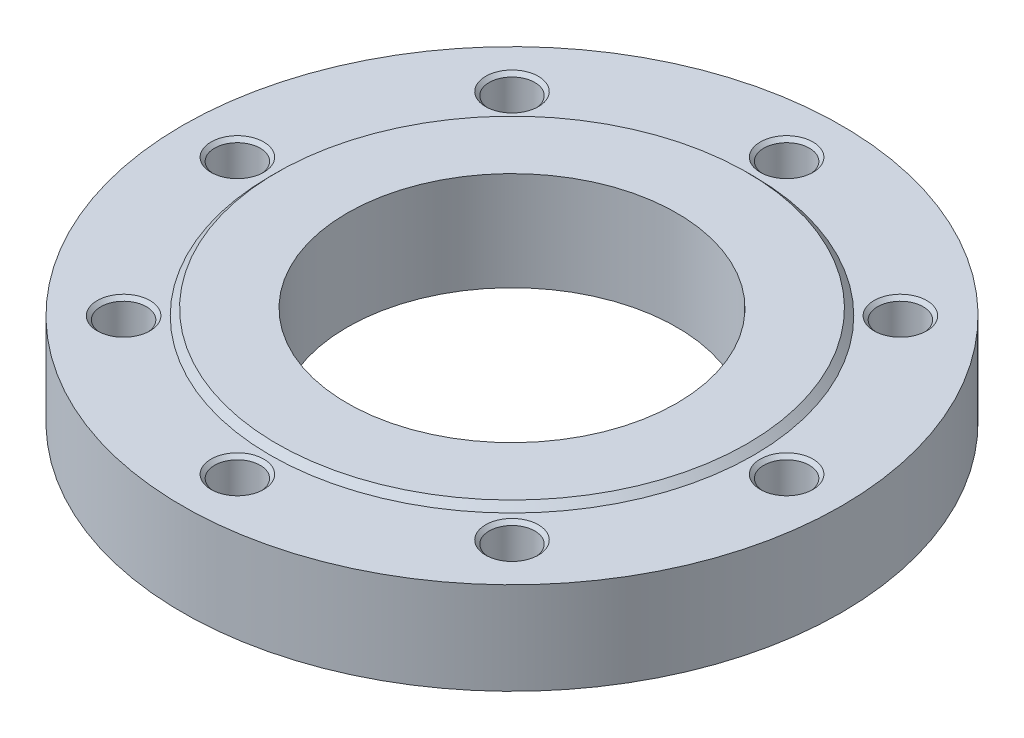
ISO-10303-21;
HEADER;
FILE_DESCRIPTION(('STEP AP214'),'2;1');
FILE_NAME('part.step','',(''),(''),'','','');
FILE_SCHEMA(('AUTOMOTIVE_DESIGN { 1 0 10303 214 1 1 1 1 }'));
ENDSEC;
DATA;
#1=APPLICATION_CONTEXT('core data for automotive mechanical design processes');
#2=APPLICATION_PROTOCOL_DEFINITION('international standard','automotive_design',2000,#1);
#3=PRODUCT_CONTEXT('',#1,'mechanical');
#4=PRODUCT('Part','Part','',(#3));
#5=PRODUCT_RELATED_PRODUCT_CATEGORY('part','',(#4));
#6=PRODUCT_DEFINITION_FORMATION('','',#4);
#7=PRODUCT_DEFINITION_CONTEXT('part definition',#1,'design');
#8=PRODUCT_DEFINITION('design','',#6,#7);
#9=PRODUCT_DEFINITION_SHAPE('','',#8);
#10=(LENGTH_UNIT() NAMED_UNIT(*) SI_UNIT(.MILLI.,.METRE.));
#11=(NAMED_UNIT(*) PLANE_ANGLE_UNIT() SI_UNIT($,.RADIAN.));
#12=(NAMED_UNIT(*) SI_UNIT($,.STERADIAN.) SOLID_ANGLE_UNIT());
#13=UNCERTAINTY_MEASURE_WITH_UNIT(LENGTH_MEASURE(1.E-05),#10,'distance_accuracy_value','');
#14=(GEOMETRIC_REPRESENTATION_CONTEXT(3) GLOBAL_UNCERTAINTY_ASSIGNED_CONTEXT((#13)) GLOBAL_UNIT_ASSIGNED_CONTEXT((#10,
#11,#12)) REPRESENTATION_CONTEXT('',''));
#15=CARTESIAN_POINT('',(0.,0.,0.));
#16=DIRECTION('',(0.,0.,1.));
#17=DIRECTION('',(1.,0.,0.));
#18=AXIS2_PLACEMENT_3D('',#15,#16,#17);
#19=CARTESIAN_POINT('',(0.,21.,0.));
#20=DIRECTION('',(0.,-1.,0.));
#21=DIRECTION('',(1.,0.,0.));
#22=AXIS2_PLACEMENT_3D('',#19,#20,#21);
#23=CYLINDRICAL_SURFACE('',#22,150.);
#24=CARTESIAN_POINT('',(0.,0.,0.));
#25=DIRECTION('',(0.,1.,0.));
#26=DIRECTION('',(1.,0.,0.));
#27=AXIS2_PLACEMENT_3D('',#24,#25,#26);
#28=CIRCLE('',#27,150.);
#29=CARTESIAN_POINT('',(150.,0.,0.));
#30=VERTEX_POINT('',#29);
#31=EDGE_CURVE('E9',#30,#30,#28,.T.);
#32=ORIENTED_EDGE('',*,*,#31,.T.);
#33=EDGE_LOOP('',(#32));
#34=FACE_BOUND('',#33,.T.);
#35=CARTESIAN_POINT('',(0.,42.,0.));
#36=DIRECTION('',(0.,1.,0.));
#37=DIRECTION('',(1.,0.,0.));
#38=AXIS2_PLACEMENT_3D('',#35,#36,#37);
#39=CIRCLE('',#38,150.);
#40=CARTESIAN_POINT('',(150.,42.,0.));
#41=VERTEX_POINT('',#40);
#42=EDGE_CURVE('E267',#41,#41,#39,.T.);
#43=ORIENTED_EDGE('',*,*,#42,.F.);
#44=EDGE_LOOP('',(#43));
#45=FACE_BOUND('',#44,.T.);
#46=ADVANCED_FACE('F15',(#34,#45),#23,.T.);
#47=CARTESIAN_POINT('',(112.5,0.,0.));
#48=DIRECTION('',(0.,-1.,0.));
#49=DIRECTION('',(-1.,0.,0.));
#50=AXIS2_PLACEMENT_3D('',#47,#48,#49);
#51=PLANE('',#50);
#52=CARTESIAN_POINT('',(0.,0.,0.));
#53=DIRECTION('',(0.,1.,0.));
#54=DIRECTION('',(1.,0.,0.));
#55=AXIS2_PLACEMENT_3D('',#52,#53,#54);
#56=CIRCLE('',#55,75.);
#57=CARTESIAN_POINT('',(75.,0.,0.));
#58=VERTEX_POINT('',#57);
#59=EDGE_CURVE('E23',#58,#58,#56,.T.);
#60=ORIENTED_EDGE('',*,*,#59,.T.);
#61=EDGE_LOOP('',(#60));
#62=FACE_BOUND('',#61,.T.);
#63=ORIENTED_EDGE('',*,*,#31,.F.);
#64=EDGE_LOOP('',(#63));
#65=FACE_BOUND('',#64,.T.);
#66=ADVANCED_FACE('F322',(#62,#65),#51,.T.);
#67=CARTESIAN_POINT('',(0.,22.5,0.));
#68=DIRECTION('',(0.,-1.,0.));
#69=DIRECTION('',(1.,0.,0.));
#70=AXIS2_PLACEMENT_3D('',#67,#68,#69);
#71=CYLINDRICAL_SURFACE('',#70,75.);
#72=CARTESIAN_POINT('',(0.,45.,0.));
#73=DIRECTION('',(0.,1.,0.));
#74=DIRECTION('',(1.,0.,0.));
#75=AXIS2_PLACEMENT_3D('',#72,#73,#74);
#76=CIRCLE('',#75,75.);
#77=CARTESIAN_POINT('',(75.,45.,0.));
#78=VERTEX_POINT('',#77);
#79=EDGE_CURVE('E170',#78,#78,#76,.T.);
#80=ORIENTED_EDGE('',*,*,#79,.T.);
#81=EDGE_LOOP('',(#80));
#82=FACE_BOUND('',#81,.T.);
#83=ORIENTED_EDGE('',*,*,#59,.F.);
#84=EDGE_LOOP('',(#83));
#85=FACE_BOUND('',#84,.T.);
#86=ADVANCED_FACE('F326',(#82,#85),#71,.F.);
#87=CARTESIAN_POINT('',(91.,45.,0.));
#88=DIRECTION('',(0.,1.,0.));
#89=DIRECTION('',(1.,0.,0.));
#90=AXIS2_PLACEMENT_3D('',#87,#88,#89);
#91=PLANE('',#90);
#92=CARTESIAN_POINT('',(0.,45.,0.));
#93=DIRECTION('',(0.,1.,0.));
#94=DIRECTION('',(1.,0.,0.));
#95=AXIS2_PLACEMENT_3D('',#92,#93,#94);
#96=CIRCLE('',#95,107.);
#97=CARTESIAN_POINT('',(107.,45.,0.));
#98=VERTEX_POINT('',#97);
#99=EDGE_CURVE('E175',#98,#98,#96,.T.);
#100=ORIENTED_EDGE('',*,*,#99,.T.);
#101=EDGE_LOOP('',(#100));
#102=FACE_BOUND('',#101,.T.);
#103=ORIENTED_EDGE('',*,*,#79,.F.);
#104=EDGE_LOOP('',(#103));
#105=FACE_BOUND('',#104,.T.);
#106=ADVANCED_FACE('F388',(#102,#105),#91,.T.);
#107=CARTESIAN_POINT('',(0.,43.5,0.));
#108=DIRECTION('',(0.,-1.,0.));
#109=DIRECTION('',(1.,0.,0.));
#110=AXIS2_PLACEMENT_3D('',#107,#108,#109);
#111=CONICAL_SURFACE('',#110,108.5,0.78539816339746);
#112=CARTESIAN_POINT('',(0.,42.,0.));
#113=DIRECTION('',(0.,1.,0.));
#114=DIRECTION('',(1.,0.,0.));
#115=AXIS2_PLACEMENT_3D('',#112,#113,#114);
#116=CIRCLE('',#115,110.);
#117=CARTESIAN_POINT('',(110.,42.,0.));
#118=VERTEX_POINT('',#117);
#119=EDGE_CURVE('E265',#118,#118,#116,.T.);
#120=ORIENTED_EDGE('',*,*,#119,.T.);
#121=EDGE_LOOP('',(#120));
#122=FACE_BOUND('',#121,.T.);
#123=ORIENTED_EDGE('',*,*,#99,.F.);
#124=EDGE_LOOP('',(#123));
#125=FACE_BOUND('',#124,.T.);
#126=ADVANCED_FACE('F335',(#122,#125),#111,.T.);
#127=CARTESIAN_POINT('',(130.,42.,0.));
#128=DIRECTION('',(0.,1.,0.));
#129=DIRECTION('',(1.,0.,0.));
#130=AXIS2_PLACEMENT_3D('',#127,#128,#129);
#131=PLANE('',#130);
#132=ORIENTED_EDGE('',*,*,#42,.T.);
#133=EDGE_LOOP('',(#132));
#134=FACE_BOUND('',#133,.T.);
#135=ORIENTED_EDGE('',*,*,#119,.F.);
#136=EDGE_LOOP('',(#135));
#137=FACE_BOUND('',#136,.T.);
#138=CARTESIAN_POINT('',(125.,42.,0.));
#139=DIRECTION('',(0.,-1.,0.));
#140=DIRECTION('',(1.,0.,0.));
#141=AXIS2_PLACEMENT_3D('',#138,#139,#140);
#142=CIRCLE('',#141,12.);
#143=CARTESIAN_POINT('',(137.,42.,0.));
#144=VERTEX_POINT('',#143);
#145=EDGE_CURVE('E255',#144,#144,#142,.T.);
#146=ORIENTED_EDGE('',*,*,#145,.T.);
#147=EDGE_LOOP('',(#146));
#148=FACE_BOUND('',#147,.T.);
#149=CARTESIAN_POINT('',(88.3883476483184,42.,-88.3883476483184));
#150=DIRECTION('',(0.,-1.,0.));
#151=DIRECTION('',(0.707106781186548,0.,-0.707106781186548));
#152=AXIS2_PLACEMENT_3D('',#149,#150,#151);
#153=CIRCLE('',#152,12.);
#154=CARTESIAN_POINT('',(96.873629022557,42.,-96.873629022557));
#155=VERTEX_POINT('',#154);
#156=EDGE_CURVE('E245',#155,#155,#153,.T.);
#157=ORIENTED_EDGE('',*,*,#156,.T.);
#158=EDGE_LOOP('',(#157));
#159=FACE_BOUND('',#158,.T.);
#160=CARTESIAN_POINT('',(0.,42.,-125.));
#161=DIRECTION('',(0.,-1.,0.));
#162=DIRECTION('',(0.,0.,-1.));
#163=AXIS2_PLACEMENT_3D('',#160,#161,#162);
#164=CIRCLE('',#163,12.);
#165=CARTESIAN_POINT('',(0.,42.,-137.));
#166=VERTEX_POINT('',#165);
#167=EDGE_CURVE('E233',#166,#166,#164,.T.);
#168=ORIENTED_EDGE('',*,*,#167,.T.);
#169=EDGE_LOOP('',(#168));
#170=FACE_BOUND('',#169,.T.);
#171=CARTESIAN_POINT('',(-88.3883476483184,42.,-88.3883476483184));
#172=DIRECTION('',(0.,-1.,0.));
#173=DIRECTION('',(-0.707106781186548,0.,-0.707106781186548));
#174=AXIS2_PLACEMENT_3D('',#171,#172,#173);
#175=CIRCLE('',#174,12.);
#176=CARTESIAN_POINT('',(-96.873629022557,42.,-96.873629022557));
#177=VERTEX_POINT('',#176);
#178=EDGE_CURVE('E216',#177,#177,#175,.T.);
#179=ORIENTED_EDGE('',*,*,#178,.T.);
#180=EDGE_LOOP('',(#179));
#181=FACE_BOUND('',#180,.T.);
#182=CARTESIAN_POINT('',(-125.,42.,0.));
#183=DIRECTION('',(0.,-1.,0.));
#184=DIRECTION('',(-1.,0.,0.));
#185=AXIS2_PLACEMENT_3D('',#182,#183,#184);
#186=CIRCLE('',#185,12.);
#187=CARTESIAN_POINT('',(-137.,42.,0.));
#188=VERTEX_POINT('',#187);
#189=EDGE_CURVE('E299',#188,#188,#186,.T.);
#190=ORIENTED_EDGE('',*,*,#189,.T.);
#191=EDGE_LOOP('',(#190));
#192=FACE_BOUND('',#191,.T.);
#193=CARTESIAN_POINT('',(-88.3883476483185,42.,88.3883476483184));
#194=DIRECTION('',(0.,-1.,0.));
#195=DIRECTION('',(-0.707106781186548,0.,0.707106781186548));
#196=AXIS2_PLACEMENT_3D('',#193,#194,#195);
#197=CIRCLE('',#196,12.);
#198=CARTESIAN_POINT('',(-96.873629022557,42.,96.873629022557));
#199=VERTEX_POINT('',#198);
#200=EDGE_CURVE('E281',#199,#199,#197,.T.);
#201=ORIENTED_EDGE('',*,*,#200,.T.);
#202=EDGE_LOOP('',(#201));
#203=FACE_BOUND('',#202,.T.);
#204=CARTESIAN_POINT('',(0.,42.,125.));
#205=DIRECTION('',(0.,-1.,0.));
#206=DIRECTION('',(0.,0.,1.));
#207=AXIS2_PLACEMENT_3D('',#204,#205,#206);
#208=CIRCLE('',#207,12.);
#209=CARTESIAN_POINT('',(0.,42.,137.));
#210=VERTEX_POINT('',#209);
#211=EDGE_CURVE('E287',#210,#210,#208,.T.);
#212=ORIENTED_EDGE('',*,*,#211,.T.);
#213=EDGE_LOOP('',(#212));
#214=FACE_BOUND('',#213,.T.);
#215=CARTESIAN_POINT('',(88.3883476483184,42.,88.3883476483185));
#216=DIRECTION('',(0.,-1.,0.));
#217=DIRECTION('',(0.707106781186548,0.,0.707106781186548));
#218=AXIS2_PLACEMENT_3D('',#215,#216,#217);
#219=CIRCLE('',#218,12.);
#220=CARTESIAN_POINT('',(96.873629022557,42.,96.873629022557));
#221=VERTEX_POINT('',#220);
#222=EDGE_CURVE('E355',#221,#221,#219,.T.);
#223=ORIENTED_EDGE('',*,*,#222,.T.);
#224=EDGE_LOOP('',(#223));
#225=FACE_BOUND('',#224,.T.);
#226=ADVANCED_FACE('F331',(#134,#137,#148,#159,#170,#181,#192,#203,#214,#225),#131,.T.);
#227=CARTESIAN_POINT('',(125.,6.00463463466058,0.));
#228=DIRECTION('',(0.,1.,0.));
#229=DIRECTION('',(1.,0.,0.));
#230=AXIS2_PLACEMENT_3D('',#227,#228,#229);
#231=CONICAL_SURFACE('',#230,5.188125,1.0471975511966);
#232=CARTESIAN_POINT('',(125.,9.,0.));
#233=DIRECTION('',(0.,-1.,0.));
#234=DIRECTION('',(1.,0.,0.));
#235=AXIS2_PLACEMENT_3D('',#232,#233,#234);
#236=CIRCLE('',#235,10.37625);
#237=CARTESIAN_POINT('',(135.37625,9.,0.));
#238=VERTEX_POINT('',#237);
#239=EDGE_CURVE('E263',#238,#238,#236,.T.);
#240=ORIENTED_EDGE('',*,*,#239,.F.);
#241=EDGE_LOOP('',(#240));
#242=FACE_BOUND('',#241,.T.);
#243=CARTESIAN_POINT('',(125.,3.00926926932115,0.));
#244=VERTEX_POINT('',#243);
#245=VERTEX_LOOP('',#244);
#246=FACE_BOUND('',#245,.T.);
#247=ADVANCED_FACE('F334',(#242,#246),#231,.F.);
#248=CARTESIAN_POINT('',(125.,12.688125,0.));
#249=DIRECTION('',(0.,1.,0.));
#250=DIRECTION('',(1.,0.,0.));
#251=AXIS2_PLACEMENT_3D('',#248,#249,#250);
#252=CYLINDRICAL_SURFACE('',#251,10.37625);
#253=CARTESIAN_POINT('',(125.,16.37625,0.));
#254=DIRECTION('',(0.,-1.,0.));
#255=DIRECTION('',(1.,0.,0.));
#256=AXIS2_PLACEMENT_3D('',#253,#254,#255);
#257=CIRCLE('',#256,10.37625);
#258=CARTESIAN_POINT('',(135.37625,16.37625,0.));
#259=VERTEX_POINT('',#258);
#260=EDGE_CURVE('E261',#259,#259,#257,.T.);
#261=ORIENTED_EDGE('',*,*,#260,.F.);
#262=EDGE_LOOP('',(#261));
#263=FACE_BOUND('',#262,.T.);
#264=ORIENTED_EDGE('',*,*,#239,.T.);
#265=EDGE_LOOP('',(#264));
#266=FACE_BOUND('',#265,.T.);
#267=ADVANCED_FACE('F794',(#263,#266),#252,.F.);
#268=CARTESIAN_POINT('',(125.,17.188125,0.));
#269=DIRECTION('',(0.,1.,0.));
#270=DIRECTION('',(1.,0.,0.));
#271=AXIS2_PLACEMENT_3D('',#268,#269,#270);
#272=CONICAL_SURFACE('',#271,11.188125,0.785398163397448);
#273=CARTESIAN_POINT('',(125.,18.,0.));
#274=DIRECTION('',(0.,-1.,0.));
#275=DIRECTION('',(1.,0.,0.));
#276=AXIS2_PLACEMENT_3D('',#273,#274,#275);
#277=CIRCLE('',#276,12.);
#278=CARTESIAN_POINT('',(137.,18.,0.));
#279=VERTEX_POINT('',#278);
#280=EDGE_CURVE('E259',#279,#279,#277,.T.);
#281=ORIENTED_EDGE('',*,*,#280,.F.);
#282=EDGE_LOOP('',(#281));
#283=FACE_BOUND('',#282,.T.);
#284=ORIENTED_EDGE('',*,*,#260,.T.);
#285=EDGE_LOOP('',(#284));
#286=FACE_BOUND('',#285,.T.);
#287=ADVANCED_FACE('F461',(#283,#286),#272,.F.);
#288=CARTESIAN_POINT('',(136.188125,18.,0.));
#289=DIRECTION('',(0.,1.,0.));
#290=DIRECTION('',(-1.,0.,0.));
#291=AXIS2_PLACEMENT_3D('',#288,#289,#290);
#292=PLANE('',#291);
#293=CARTESIAN_POINT('',(125.,18.,0.));
#294=DIRECTION('',(0.,-1.,0.));
#295=DIRECTION('',(1.,0.,0.));
#296=AXIS2_PLACEMENT_3D('',#293,#294,#295);
#297=CIRCLE('',#296,10.37625);
#298=CARTESIAN_POINT('',(135.37625,18.,0.));
#299=VERTEX_POINT('',#298);
#300=EDGE_CURVE('E257',#299,#299,#297,.T.);
#301=ORIENTED_EDGE('',*,*,#300,.F.);
#302=EDGE_LOOP('',(#301));
#303=FACE_BOUND('',#302,.T.);
#304=ORIENTED_EDGE('',*,*,#280,.T.);
#305=EDGE_LOOP('',(#304));
#306=FACE_BOUND('',#305,.T.);
#307=ADVANCED_FACE('F409',(#303,#306),#292,.F.);
#308=CARTESIAN_POINT('',(125.,29.188125,0.));
#309=DIRECTION('',(0.,1.,0.));
#310=DIRECTION('',(1.,0.,0.));
#311=AXIS2_PLACEMENT_3D('',#308,#309,#310);
#312=CYLINDRICAL_SURFACE('',#311,10.37625);
#313=CARTESIAN_POINT('',(125.,40.37625,0.));
#314=DIRECTION('',(0.,-1.,0.));
#315=DIRECTION('',(1.,0.,0.));
#316=AXIS2_PLACEMENT_3D('',#313,#314,#315);
#317=CIRCLE('',#316,10.37625);
#318=CARTESIAN_POINT('',(135.37625,40.37625,0.));
#319=VERTEX_POINT('',#318);
#320=EDGE_CURVE('E254',#319,#319,#317,.T.);
#321=ORIENTED_EDGE('',*,*,#320,.F.);
#322=EDGE_LOOP('',(#321));
#323=FACE_BOUND('',#322,.T.);
#324=ORIENTED_EDGE('',*,*,#300,.T.);
#325=EDGE_LOOP('',(#324));
#326=FACE_BOUND('',#325,.T.);
#327=ADVANCED_FACE('F405',(#323,#326),#312,.F.);
#328=CARTESIAN_POINT('',(125.,41.188125,0.));
#329=DIRECTION('',(0.,1.,0.));
#330=DIRECTION('',(1.,0.,0.));
#331=AXIS2_PLACEMENT_3D('',#328,#329,#330);
#332=CONICAL_SURFACE('',#331,11.188125,0.785398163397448);
#333=ORIENTED_EDGE('',*,*,#145,.F.);
#334=EDGE_LOOP('',(#333));
#335=FACE_BOUND('',#334,.T.);
#336=ORIENTED_EDGE('',*,*,#320,.T.);
#337=EDGE_LOOP('',(#336));
#338=FACE_BOUND('',#337,.T.);
#339=ADVANCED_FACE('F408',(#335,#338),#332,.F.);
#340=CARTESIAN_POINT('',(88.3883476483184,6.00463463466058,-88.3883476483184));
#341=DIRECTION('',(0.,1.,0.));
#342=DIRECTION('',(0.707106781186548,0.,-0.707106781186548));
#343=AXIS2_PLACEMENT_3D('',#340,#341,#342);
#344=CONICAL_SURFACE('',#343,5.188125,1.0471975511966);
#345=CARTESIAN_POINT('',(88.3883476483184,9.,-88.3883476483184));
#346=DIRECTION('',(0.,-1.,0.));
#347=DIRECTION('',(0.707106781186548,0.,-0.707106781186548));
#348=AXIS2_PLACEMENT_3D('',#345,#346,#347);
#349=CIRCLE('',#348,10.37625);
#350=CARTESIAN_POINT('',(95.7254643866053,9.,-95.7254643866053));
#351=VERTEX_POINT('',#350);
#352=EDGE_CURVE('E252',#351,#351,#349,.T.);
#353=ORIENTED_EDGE('',*,*,#352,.F.);
#354=EDGE_LOOP('',(#353));
#355=FACE_BOUND('',#354,.T.);
#356=CARTESIAN_POINT('',(88.3883476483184,3.00926926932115,-88.3883476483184));
#357=VERTEX_POINT('',#356);
#358=VERTEX_LOOP('',#357);
#359=FACE_BOUND('',#358,.T.);
#360=ADVANCED_FACE('F759',(#355,#359),#344,.F.);
#361=CARTESIAN_POINT('',(88.3883476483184,12.688125,-88.3883476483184));
#362=DIRECTION('',(0.,1.,0.));
#363=DIRECTION('',(0.707106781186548,0.,-0.707106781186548));
#364=AXIS2_PLACEMENT_3D('',#361,#362,#363);
#365=CYLINDRICAL_SURFACE('',#364,10.37625);
#366=CARTESIAN_POINT('',(88.3883476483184,16.37625,-88.3883476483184));
#367=DIRECTION('',(0.,-1.,0.));
#368=DIRECTION('',(0.707106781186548,0.,-0.707106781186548));
#369=AXIS2_PLACEMENT_3D('',#366,#367,#368);
#370=CIRCLE('',#369,10.37625);
#371=CARTESIAN_POINT('',(95.7254643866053,16.37625,-95.7254643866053));
#372=VERTEX_POINT('',#371);
#373=EDGE_CURVE('E250',#372,#372,#370,.T.);
#374=ORIENTED_EDGE('',*,*,#373,.F.);
#375=EDGE_LOOP('',(#374));
#376=FACE_BOUND('',#375,.T.);
#377=ORIENTED_EDGE('',*,*,#352,.T.);
#378=EDGE_LOOP('',(#377));
#379=FACE_BOUND('',#378,.T.);
#380=ADVANCED_FACE('F750',(#376,#379),#365,.F.);
#381=CARTESIAN_POINT('',(88.3883476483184,17.188125,-88.3883476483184));
#382=DIRECTION('',(0.,1.,0.));
#383=DIRECTION('',(0.707106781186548,0.,-0.707106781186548));
#384=AXIS2_PLACEMENT_3D('',#381,#382,#383);
#385=CONICAL_SURFACE('',#384,11.188125,0.785398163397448);
#386=CARTESIAN_POINT('',(88.3883476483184,18.,-88.3883476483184));
#387=DIRECTION('',(0.,-1.,0.));
#388=DIRECTION('',(0.707106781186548,0.,-0.707106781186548));
#389=AXIS2_PLACEMENT_3D('',#386,#387,#388);
#390=CIRCLE('',#389,12.);
#391=CARTESIAN_POINT('',(96.873629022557,18.,-96.873629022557));
#392=VERTEX_POINT('',#391);
#393=EDGE_CURVE('E248',#392,#392,#390,.T.);
#394=ORIENTED_EDGE('',*,*,#393,.F.);
#395=EDGE_LOOP('',(#394));
#396=FACE_BOUND('',#395,.T.);
#397=ORIENTED_EDGE('',*,*,#373,.T.);
#398=EDGE_LOOP('',(#397));
#399=FACE_BOUND('',#398,.T.);
#400=ADVANCED_FACE('F741',(#396,#399),#385,.F.);
#401=CARTESIAN_POINT('',(96.2995467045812,18.,-96.2995467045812));
#402=DIRECTION('',(0.,1.,0.));
#403=DIRECTION('',(-0.707106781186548,0.,0.707106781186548));
#404=AXIS2_PLACEMENT_3D('',#401,#402,#403);
#405=PLANE('',#404);
#406=CARTESIAN_POINT('',(88.3883476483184,18.,-88.3883476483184));
#407=DIRECTION('',(0.,-1.,0.));
#408=DIRECTION('',(0.707106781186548,0.,-0.707106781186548));
#409=AXIS2_PLACEMENT_3D('',#406,#407,#408);
#410=CIRCLE('',#409,10.37625);
#411=CARTESIAN_POINT('',(95.7254643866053,18.,-95.7254643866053));
#412=VERTEX_POINT('',#411);
#413=EDGE_CURVE('E247',#412,#412,#410,.T.);
#414=ORIENTED_EDGE('',*,*,#413,.F.);
#415=EDGE_LOOP('',(#414));
#416=FACE_BOUND('',#415,.T.);
#417=ORIENTED_EDGE('',*,*,#393,.T.);
#418=EDGE_LOOP('',(#417));
#419=FACE_BOUND('',#418,.T.);
#420=ADVANCED_FACE('F732',(#416,#419),#405,.F.);
#421=CARTESIAN_POINT('',(88.3883476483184,29.188125,-88.3883476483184));
#422=DIRECTION('',(0.,1.,0.));
#423=DIRECTION('',(0.707106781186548,0.,-0.707106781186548));
#424=AXIS2_PLACEMENT_3D('',#421,#422,#423);
#425=CYLINDRICAL_SURFACE('',#424,10.37625);
#426=CARTESIAN_POINT('',(88.3883476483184,40.37625,-88.3883476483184));
#427=DIRECTION('',(0.,-1.,0.));
#428=DIRECTION('',(0.707106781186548,0.,-0.707106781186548));
#429=AXIS2_PLACEMENT_3D('',#426,#427,#428);
#430=CIRCLE('',#429,10.37625);
#431=CARTESIAN_POINT('',(95.7254643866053,40.37625,-95.7254643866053));
#432=VERTEX_POINT('',#431);
#433=EDGE_CURVE('E243',#432,#432,#430,.T.);
#434=ORIENTED_EDGE('',*,*,#433,.F.);
#435=EDGE_LOOP('',(#434));
#436=FACE_BOUND('',#435,.T.);
#437=ORIENTED_EDGE('',*,*,#413,.T.);
#438=EDGE_LOOP('',(#437));
#439=FACE_BOUND('',#438,.T.);
#440=ADVANCED_FACE('F723',(#436,#439),#425,.F.);
#441=CARTESIAN_POINT('',(88.3883476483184,41.188125,-88.3883476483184));
#442=DIRECTION('',(0.,1.,0.));
#443=DIRECTION('',(0.707106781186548,0.,-0.707106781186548));
#444=AXIS2_PLACEMENT_3D('',#441,#442,#443);
#445=CONICAL_SURFACE('',#444,11.188125,0.785398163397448);
#446=ORIENTED_EDGE('',*,*,#156,.F.);
#447=EDGE_LOOP('',(#446));
#448=FACE_BOUND('',#447,.T.);
#449=ORIENTED_EDGE('',*,*,#433,.T.);
#450=EDGE_LOOP('',(#449));
#451=FACE_BOUND('',#450,.T.);
#452=ADVANCED_FACE('F714',(#448,#451),#445,.F.);
#453=CARTESIAN_POINT('',(0.,6.00463463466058,-125.));
#454=DIRECTION('',(0.,1.,0.));
#455=DIRECTION('',(0.,0.,-1.));
#456=AXIS2_PLACEMENT_3D('',#453,#454,#455);
#457=CONICAL_SURFACE('',#456,5.188125,1.0471975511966);
#458=CARTESIAN_POINT('',(0.,9.,-125.));
#459=DIRECTION('',(0.,-1.,0.));
#460=DIRECTION('',(0.,0.,-1.));
#461=AXIS2_PLACEMENT_3D('',#458,#459,#460);
#462=CIRCLE('',#461,10.37625);
#463=CARTESIAN_POINT('',(0.,9.,-135.37625));
#464=VERTEX_POINT('',#463);
#465=EDGE_CURVE('E241',#464,#464,#462,.T.);
#466=ORIENTED_EDGE('',*,*,#465,.F.);
#467=EDGE_LOOP('',(#466));
#468=FACE_BOUND('',#467,.T.);
#469=CARTESIAN_POINT('',(0.,3.00926926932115,-125.));
#470=VERTEX_POINT('',#469);
#471=VERTEX_LOOP('',#470);
#472=FACE_BOUND('',#471,.T.);
#473=ADVANCED_FACE('F705',(#468,#472),#457,.F.);
#474=CARTESIAN_POINT('',(0.,12.688125,-125.));
#475=DIRECTION('',(0.,1.,0.));
#476=DIRECTION('',(0.,0.,-1.));
#477=AXIS2_PLACEMENT_3D('',#474,#475,#476);
#478=CYLINDRICAL_SURFACE('',#477,10.37625);
#479=CARTESIAN_POINT('',(0.,16.37625,-125.));
#480=DIRECTION('',(0.,-1.,0.));
#481=DIRECTION('',(0.,0.,-1.));
#482=AXIS2_PLACEMENT_3D('',#479,#480,#481);
#483=CIRCLE('',#482,10.37625);
#484=CARTESIAN_POINT('',(0.,16.37625,-135.37625));
#485=VERTEX_POINT('',#484);
#486=EDGE_CURVE('E239',#485,#485,#483,.T.);
#487=ORIENTED_EDGE('',*,*,#486,.F.);
#488=EDGE_LOOP('',(#487));
#489=FACE_BOUND('',#488,.T.);
#490=ORIENTED_EDGE('',*,*,#465,.T.);
#491=EDGE_LOOP('',(#490));
#492=FACE_BOUND('',#491,.T.);
#493=ADVANCED_FACE('F450',(#489,#492),#478,.F.);
#494=CARTESIAN_POINT('',(0.,17.188125,-125.));
#495=DIRECTION('',(0.,1.,0.));
#496=DIRECTION('',(0.,0.,-1.));
#497=AXIS2_PLACEMENT_3D('',#494,#495,#496);
#498=CONICAL_SURFACE('',#497,11.188125,0.785398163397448);
#499=CARTESIAN_POINT('',(0.,18.,-125.));
#500=DIRECTION('',(0.,-1.,0.));
#501=DIRECTION('',(0.,0.,-1.));
#502=AXIS2_PLACEMENT_3D('',#499,#500,#501);
#503=CIRCLE('',#502,12.);
#504=CARTESIAN_POINT('',(0.,18.,-137.));
#505=VERTEX_POINT('',#504);
#506=EDGE_CURVE('E237',#505,#505,#503,.T.);
#507=ORIENTED_EDGE('',*,*,#506,.F.);
#508=EDGE_LOOP('',(#507));
#509=FACE_BOUND('',#508,.T.);
#510=ORIENTED_EDGE('',*,*,#486,.T.);
#511=EDGE_LOOP('',(#510));
#512=FACE_BOUND('',#511,.T.);
#513=ADVANCED_FACE('F446',(#509,#512),#498,.F.);
#514=CARTESIAN_POINT('',(0.,18.,-136.188125));
#515=DIRECTION('',(0.,1.,0.));
#516=DIRECTION('',(0.,0.,1.));
#517=AXIS2_PLACEMENT_3D('',#514,#515,#516);
#518=PLANE('',#517);
#519=CARTESIAN_POINT('',(0.,18.,-125.));
#520=DIRECTION('',(0.,-1.,0.));
#521=DIRECTION('',(0.,0.,-1.));
#522=AXIS2_PLACEMENT_3D('',#519,#520,#521);
#523=CIRCLE('',#522,10.37625);
#524=CARTESIAN_POINT('',(0.,18.,-135.37625));
#525=VERTEX_POINT('',#524);
#526=EDGE_CURVE('E235',#525,#525,#523,.T.);
#527=ORIENTED_EDGE('',*,*,#526,.F.);
#528=EDGE_LOOP('',(#527));
#529=FACE_BOUND('',#528,.T.);
#530=ORIENTED_EDGE('',*,*,#506,.T.);
#531=EDGE_LOOP('',(#530));
#532=FACE_BOUND('',#531,.T.);
#533=ADVANCED_FACE('F449',(#529,#532),#518,.F.);
#534=CARTESIAN_POINT('',(0.,29.188125,-125.));
#535=DIRECTION('',(0.,1.,0.));
#536=DIRECTION('',(0.,0.,-1.));
#537=AXIS2_PLACEMENT_3D('',#534,#535,#536);
#538=CYLINDRICAL_SURFACE('',#537,10.37625);
#539=CARTESIAN_POINT('',(0.,40.37625,-125.));
#540=DIRECTION('',(0.,-1.,0.));
#541=DIRECTION('',(0.,0.,-1.));
#542=AXIS2_PLACEMENT_3D('',#539,#540,#541);
#543=CIRCLE('',#542,10.37625);
#544=CARTESIAN_POINT('',(0.,40.37625,-135.37625));
#545=VERTEX_POINT('',#544);
#546=EDGE_CURVE('E231',#545,#545,#543,.T.);
#547=ORIENTED_EDGE('',*,*,#546,.F.);
#548=EDGE_LOOP('',(#547));
#549=FACE_BOUND('',#548,.T.);
#550=ORIENTED_EDGE('',*,*,#526,.T.);
#551=EDGE_LOOP('',(#550));
#552=FACE_BOUND('',#551,.T.);
#553=ADVANCED_FACE('F480',(#549,#552),#538,.F.);
#554=CARTESIAN_POINT('',(0.,41.188125,-125.));
#555=DIRECTION('',(0.,1.,0.));
#556=DIRECTION('',(0.,0.,-1.));
#557=AXIS2_PLACEMENT_3D('',#554,#555,#556);
#558=CONICAL_SURFACE('',#557,11.188125,0.785398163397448);
#559=ORIENTED_EDGE('',*,*,#167,.F.);
#560=EDGE_LOOP('',(#559));
#561=FACE_BOUND('',#560,.T.);
#562=ORIENTED_EDGE('',*,*,#546,.T.);
#563=EDGE_LOOP('',(#562));
#564=FACE_BOUND('',#563,.T.);
#565=ADVANCED_FACE('F670',(#561,#564),#558,.F.);
#566=CARTESIAN_POINT('',(-88.3883476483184,6.00463463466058,-88.3883476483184));
#567=DIRECTION('',(0.,1.,0.));
#568=DIRECTION('',(-0.707106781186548,0.,-0.707106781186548));
#569=AXIS2_PLACEMENT_3D('',#566,#567,#568);
#570=CONICAL_SURFACE('',#569,5.188125,1.0471975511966);
#571=CARTESIAN_POINT('',(-88.3883476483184,9.,-88.3883476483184));
#572=DIRECTION('',(0.,-1.,0.));
#573=DIRECTION('',(-0.707106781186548,0.,-0.707106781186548));
#574=AXIS2_PLACEMENT_3D('',#571,#572,#573);
#575=CIRCLE('',#574,10.37625);
#576=CARTESIAN_POINT('',(-95.7254643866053,9.,-95.7254643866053));
#577=VERTEX_POINT('',#576);
#578=EDGE_CURVE('E229',#577,#577,#575,.T.);
#579=ORIENTED_EDGE('',*,*,#578,.F.);
#580=EDGE_LOOP('',(#579));
#581=FACE_BOUND('',#580,.T.);
#582=CARTESIAN_POINT('',(-88.3883476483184,3.00926926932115,-88.3883476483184));
#583=VERTEX_POINT('',#582);
#584=VERTEX_LOOP('',#583);
#585=FACE_BOUND('',#584,.T.);
#586=ADVANCED_FACE('F661',(#581,#585),#570,.F.);
#587=CARTESIAN_POINT('',(-88.3883476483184,12.688125,-88.3883476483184));
#588=DIRECTION('',(0.,1.,0.));
#589=DIRECTION('',(-0.707106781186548,0.,-0.707106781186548));
#590=AXIS2_PLACEMENT_3D('',#587,#588,#589);
#591=CYLINDRICAL_SURFACE('',#590,10.37625);
#592=CARTESIAN_POINT('',(-88.3883476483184,16.37625,-88.3883476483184));
#593=DIRECTION('',(0.,-1.,0.));
#594=DIRECTION('',(-0.707106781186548,0.,-0.707106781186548));
#595=AXIS2_PLACEMENT_3D('',#592,#593,#594);
#596=CIRCLE('',#595,10.37625);
#597=CARTESIAN_POINT('',(-95.7254643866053,16.37625,-95.7254643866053));
#598=VERTEX_POINT('',#597);
#599=EDGE_CURVE('E227',#598,#598,#596,.T.);
#600=ORIENTED_EDGE('',*,*,#599,.F.);
#601=EDGE_LOOP('',(#600));
#602=FACE_BOUND('',#601,.T.);
#603=ORIENTED_EDGE('',*,*,#578,.T.);
#604=EDGE_LOOP('',(#603));
#605=FACE_BOUND('',#604,.T.);
#606=ADVANCED_FACE('F652',(#602,#605),#591,.F.);
#607=CARTESIAN_POINT('',(-88.3883476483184,17.188125,-88.3883476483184));
#608=DIRECTION('',(0.,1.,0.));
#609=DIRECTION('',(-0.707106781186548,0.,-0.707106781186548));
#610=AXIS2_PLACEMENT_3D('',#607,#608,#609);
#611=CONICAL_SURFACE('',#610,11.188125,0.785398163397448);
#612=CARTESIAN_POINT('',(-88.3883476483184,18.,-88.3883476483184));
#613=DIRECTION('',(0.,-1.,0.));
#614=DIRECTION('',(-0.707106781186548,0.,-0.707106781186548));
#615=AXIS2_PLACEMENT_3D('',#612,#613,#614);
#616=CIRCLE('',#615,12.);
#617=CARTESIAN_POINT('',(-96.873629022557,18.,-96.873629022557));
#618=VERTEX_POINT('',#617);
#619=EDGE_CURVE('E225',#618,#618,#616,.T.);
#620=ORIENTED_EDGE('',*,*,#619,.F.);
#621=EDGE_LOOP('',(#620));
#622=FACE_BOUND('',#621,.T.);
#623=ORIENTED_EDGE('',*,*,#599,.T.);
#624=EDGE_LOOP('',(#623));
#625=FACE_BOUND('',#624,.T.);
#626=ADVANCED_FACE('F643',(#622,#625),#611,.F.);
#627=CARTESIAN_POINT('',(-96.2995467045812,18.,-96.2995467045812));
#628=DIRECTION('',(0.,1.,0.));
#629=DIRECTION('',(0.707106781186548,0.,0.707106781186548));
#630=AXIS2_PLACEMENT_3D('',#627,#628,#629);
#631=PLANE('',#630);
#632=CARTESIAN_POINT('',(-88.3883476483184,18.,-88.3883476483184));
#633=DIRECTION('',(0.,-1.,0.));
#634=DIRECTION('',(-0.707106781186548,0.,-0.707106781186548));
#635=AXIS2_PLACEMENT_3D('',#632,#633,#634);
#636=CIRCLE('',#635,10.37625);
#637=CARTESIAN_POINT('',(-95.7254643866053,18.,-95.7254643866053));
#638=VERTEX_POINT('',#637);
#639=EDGE_CURVE('E223',#638,#638,#636,.T.);
#640=ORIENTED_EDGE('',*,*,#639,.F.);
#641=EDGE_LOOP('',(#640));
#642=FACE_BOUND('',#641,.T.);
#643=ORIENTED_EDGE('',*,*,#619,.T.);
#644=EDGE_LOOP('',(#643));
#645=FACE_BOUND('',#644,.T.);
#646=ADVANCED_FACE('F634',(#642,#645),#631,.F.);
#647=CARTESIAN_POINT('',(-88.3883476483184,29.188125,-88.3883476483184));
#648=DIRECTION('',(0.,1.,0.));
#649=DIRECTION('',(-0.707106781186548,0.,-0.707106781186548));
#650=AXIS2_PLACEMENT_3D('',#647,#648,#649);
#651=CYLINDRICAL_SURFACE('',#650,10.37625);
#652=CARTESIAN_POINT('',(-88.3883476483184,40.37625,-88.3883476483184));
#653=DIRECTION('',(0.,-1.,0.));
#654=DIRECTION('',(-0.707106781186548,0.,-0.707106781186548));
#655=AXIS2_PLACEMENT_3D('',#652,#653,#654);
#656=CIRCLE('',#655,10.37625);
#657=CARTESIAN_POINT('',(-95.7254643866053,40.37625,-95.7254643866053));
#658=VERTEX_POINT('',#657);
#659=EDGE_CURVE('E213',#658,#658,#656,.T.);
#660=ORIENTED_EDGE('',*,*,#659,.F.);
#661=EDGE_LOOP('',(#660));
#662=FACE_BOUND('',#661,.T.);
#663=ORIENTED_EDGE('',*,*,#639,.T.);
#664=EDGE_LOOP('',(#663));
#665=FACE_BOUND('',#664,.T.);
#666=ADVANCED_FACE('F426',(#662,#665),#651,.F.);
#667=CARTESIAN_POINT('',(-88.3883476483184,41.188125,-88.3883476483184));
#668=DIRECTION('',(0.,1.,0.));
#669=DIRECTION('',(-0.707106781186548,0.,-0.707106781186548));
#670=AXIS2_PLACEMENT_3D('',#667,#668,#669);
#671=CONICAL_SURFACE('',#670,11.188125,0.785398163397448);
#672=ORIENTED_EDGE('',*,*,#178,.F.);
#673=EDGE_LOOP('',(#672));
#674=FACE_BOUND('',#673,.T.);
#675=ORIENTED_EDGE('',*,*,#659,.T.);
#676=EDGE_LOOP('',(#675));
#677=FACE_BOUND('',#676,.T.);
#678=ADVANCED_FACE('F319',(#674,#677),#671,.F.);
#679=CARTESIAN_POINT('',(-125.,6.00463463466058,0.));
#680=DIRECTION('',(0.,1.,0.));
#681=DIRECTION('',(-1.,0.,0.));
#682=AXIS2_PLACEMENT_3D('',#679,#680,#681);
#683=CONICAL_SURFACE('',#682,5.188125,1.0471975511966);
#684=CARTESIAN_POINT('',(-125.,9.,0.));
#685=DIRECTION('',(0.,-1.,0.));
#686=DIRECTION('',(-1.,0.,0.));
#687=AXIS2_PLACEMENT_3D('',#684,#685,#686);
#688=CIRCLE('',#687,10.37625);
#689=CARTESIAN_POINT('',(-135.37625,9.,0.));
#690=VERTEX_POINT('',#689);
#691=EDGE_CURVE('E210',#690,#690,#688,.T.);
#692=ORIENTED_EDGE('',*,*,#691,.F.);
#693=EDGE_LOOP('',(#692));
#694=FACE_BOUND('',#693,.T.);
#695=CARTESIAN_POINT('',(-125.,3.00926926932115,0.));
#696=VERTEX_POINT('',#695);
#697=VERTEX_LOOP('',#696);
#698=FACE_BOUND('',#697,.T.);
#699=ADVANCED_FACE('F313',(#694,#698),#683,.F.);
#700=CARTESIAN_POINT('',(-125.,12.688125,0.));
#701=DIRECTION('',(0.,1.,0.));
#702=DIRECTION('',(-1.,0.,0.));
#703=AXIS2_PLACEMENT_3D('',#700,#701,#702);
#704=CYLINDRICAL_SURFACE('',#703,10.37625);
#705=CARTESIAN_POINT('',(-125.,16.37625,0.));
#706=DIRECTION('',(0.,-1.,0.));
#707=DIRECTION('',(-1.,0.,0.));
#708=AXIS2_PLACEMENT_3D('',#705,#706,#707);
#709=CIRCLE('',#708,10.37625);
#710=CARTESIAN_POINT('',(-135.37625,16.37625,0.));
#711=VERTEX_POINT('',#710);
#712=EDGE_CURVE('E214',#711,#711,#709,.T.);
#713=ORIENTED_EDGE('',*,*,#712,.F.);
#714=EDGE_LOOP('',(#713));
#715=FACE_BOUND('',#714,.T.);
#716=ORIENTED_EDGE('',*,*,#691,.T.);
#717=EDGE_LOOP('',(#716));
#718=FACE_BOUND('',#717,.T.);
#719=ADVANCED_FACE('F211',(#715,#718),#704,.F.);
#720=CARTESIAN_POINT('',(-125.,17.188125,0.));
#721=DIRECTION('',(0.,1.,0.));
#722=DIRECTION('',(-1.,0.,0.));
#723=AXIS2_PLACEMENT_3D('',#720,#721,#722);
#724=CONICAL_SURFACE('',#723,11.188125,0.785398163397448);
#725=CARTESIAN_POINT('',(-125.,18.,0.));
#726=DIRECTION('',(0.,-1.,0.));
#727=DIRECTION('',(-1.,0.,0.));
#728=AXIS2_PLACEMENT_3D('',#725,#726,#727);
#729=CIRCLE('',#728,12.);
#730=CARTESIAN_POINT('',(-137.,18.,0.));
#731=VERTEX_POINT('',#730);
#732=EDGE_CURVE('E218',#731,#731,#729,.T.);
#733=ORIENTED_EDGE('',*,*,#732,.F.);
#734=EDGE_LOOP('',(#733));
#735=FACE_BOUND('',#734,.T.);
#736=ORIENTED_EDGE('',*,*,#712,.T.);
#737=EDGE_LOOP('',(#736));
#738=FACE_BOUND('',#737,.T.);
#739=ADVANCED_FACE('F306',(#735,#738),#724,.F.);
#740=CARTESIAN_POINT('',(-136.188125,18.,0.));
#741=DIRECTION('',(0.,1.,0.));
#742=DIRECTION('',(1.,0.,0.));
#743=AXIS2_PLACEMENT_3D('',#740,#741,#742);
#744=PLANE('',#743);
#745=CARTESIAN_POINT('',(-125.,18.,0.));
#746=DIRECTION('',(0.,-1.,0.));
#747=DIRECTION('',(-1.,0.,0.));
#748=AXIS2_PLACEMENT_3D('',#745,#746,#747);
#749=CIRCLE('',#748,10.37625);
#750=CARTESIAN_POINT('',(-135.37625,18.,0.));
#751=VERTEX_POINT('',#750);
#752=EDGE_CURVE('E301',#751,#751,#749,.T.);
#753=ORIENTED_EDGE('',*,*,#752,.F.);
#754=EDGE_LOOP('',(#753));
#755=FACE_BOUND('',#754,.T.);
#756=ORIENTED_EDGE('',*,*,#732,.T.);
#757=EDGE_LOOP('',(#756));
#758=FACE_BOUND('',#757,.T.);
#759=ADVANCED_FACE('F304',(#755,#758),#744,.F.);
#760=CARTESIAN_POINT('',(-125.,29.188125,0.));
#761=DIRECTION('',(0.,1.,0.));
#762=DIRECTION('',(-1.,0.,0.));
#763=AXIS2_PLACEMENT_3D('',#760,#761,#762);
#764=CYLINDRICAL_SURFACE('',#763,10.37625);
#765=CARTESIAN_POINT('',(-125.,40.37625,0.));
#766=DIRECTION('',(0.,-1.,0.));
#767=DIRECTION('',(-1.,0.,0.));
#768=AXIS2_PLACEMENT_3D('',#765,#766,#767);
#769=CIRCLE('',#768,10.37625);
#770=CARTESIAN_POINT('',(-135.37625,40.37625,0.));
#771=VERTEX_POINT('',#770);
#772=EDGE_CURVE('E298',#771,#771,#769,.T.);
#773=ORIENTED_EDGE('',*,*,#772,.F.);
#774=EDGE_LOOP('',(#773));
#775=FACE_BOUND('',#774,.T.);
#776=ORIENTED_EDGE('',*,*,#752,.T.);
#777=EDGE_LOOP('',(#776));
#778=FACE_BOUND('',#777,.T.);
#779=ADVANCED_FACE('F373',(#775,#778),#764,.F.);
#780=CARTESIAN_POINT('',(-125.,41.188125,0.));
#781=DIRECTION('',(0.,1.,0.));
#782=DIRECTION('',(-1.,0.,0.));
#783=AXIS2_PLACEMENT_3D('',#780,#781,#782);
#784=CONICAL_SURFACE('',#783,11.188125,0.785398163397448);
#785=ORIENTED_EDGE('',*,*,#189,.F.);
#786=EDGE_LOOP('',(#785));
#787=FACE_BOUND('',#786,.T.);
#788=ORIENTED_EDGE('',*,*,#772,.T.);
#789=EDGE_LOOP('',(#788));
#790=FACE_BOUND('',#789,.T.);
#791=ADVANCED_FACE('F371',(#787,#790),#784,.F.);
#792=CARTESIAN_POINT('',(-88.3883476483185,6.00463463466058,88.3883476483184));
#793=DIRECTION('',(0.,1.,0.));
#794=DIRECTION('',(-0.707106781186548,0.,0.707106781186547));
#795=AXIS2_PLACEMENT_3D('',#792,#793,#794);
#796=CONICAL_SURFACE('',#795,5.188125,1.0471975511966);
#797=CARTESIAN_POINT('',(-88.3883476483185,9.,88.3883476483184));
#798=DIRECTION('',(0.,-1.,0.));
#799=DIRECTION('',(-0.707106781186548,0.,0.707106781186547));
#800=AXIS2_PLACEMENT_3D('',#797,#798,#799);
#801=CIRCLE('',#800,10.37625);
#802=CARTESIAN_POINT('',(-95.7254643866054,9.,95.7254643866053));
#803=VERTEX_POINT('',#802);
#804=EDGE_CURVE('E296',#803,#803,#801,.T.);
#805=ORIENTED_EDGE('',*,*,#804,.F.);
#806=EDGE_LOOP('',(#805));
#807=FACE_BOUND('',#806,.T.);
#808=CARTESIAN_POINT('',(-88.3883476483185,3.00926926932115,88.3883476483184));
#809=VERTEX_POINT('',#808);
#810=VERTEX_LOOP('',#809);
#811=FACE_BOUND('',#810,.T.);
#812=ADVANCED_FACE('F386',(#807,#811),#796,.F.);
#813=CARTESIAN_POINT('',(-88.3883476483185,12.688125,88.3883476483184));
#814=DIRECTION('',(0.,1.,0.));
#815=DIRECTION('',(-0.707106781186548,0.,0.707106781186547));
#816=AXIS2_PLACEMENT_3D('',#813,#814,#815);
#817=CYLINDRICAL_SURFACE('',#816,10.37625);
#818=CARTESIAN_POINT('',(-88.3883476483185,16.37625,88.3883476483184));
#819=DIRECTION('',(0.,-1.,0.));
#820=DIRECTION('',(-0.707106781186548,0.,0.707106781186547));
#821=AXIS2_PLACEMENT_3D('',#818,#819,#820);
#822=CIRCLE('',#821,10.37625);
#823=CARTESIAN_POINT('',(-95.7254643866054,16.37625,95.7254643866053));
#824=VERTEX_POINT('',#823);
#825=EDGE_CURVE('E293',#824,#824,#822,.T.);
#826=ORIENTED_EDGE('',*,*,#825,.F.);
#827=EDGE_LOOP('',(#826));
#828=FACE_BOUND('',#827,.T.);
#829=ORIENTED_EDGE('',*,*,#804,.T.);
#830=EDGE_LOOP('',(#829));
#831=FACE_BOUND('',#830,.T.);
#832=ADVANCED_FACE('F393',(#828,#831),#817,.F.);
#833=CARTESIAN_POINT('',(-88.3883476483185,17.188125,88.3883476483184));
#834=DIRECTION('',(0.,1.,0.));
#835=DIRECTION('',(-0.707106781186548,0.,0.707106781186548));
#836=AXIS2_PLACEMENT_3D('',#833,#834,#835);
#837=CONICAL_SURFACE('',#836,11.188125,0.785398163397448);
#838=CARTESIAN_POINT('',(-88.3883476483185,18.,88.3883476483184));
#839=DIRECTION('',(0.,-1.,0.));
#840=DIRECTION('',(-0.707106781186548,0.,0.707106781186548));
#841=AXIS2_PLACEMENT_3D('',#838,#839,#840);
#842=CIRCLE('',#841,12.);
#843=CARTESIAN_POINT('',(-96.873629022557,18.,96.873629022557));
#844=VERTEX_POINT('',#843);
#845=EDGE_CURVE('E291',#844,#844,#842,.T.);
#846=ORIENTED_EDGE('',*,*,#845,.F.);
#847=EDGE_LOOP('',(#846));
#848=FACE_BOUND('',#847,.T.);
#849=ORIENTED_EDGE('',*,*,#825,.T.);
#850=EDGE_LOOP('',(#849));
#851=FACE_BOUND('',#850,.T.);
#852=ADVANCED_FACE('F397',(#848,#851),#837,.F.);
#853=CARTESIAN_POINT('',(-96.2995467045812,18.,96.2995467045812));
#854=DIRECTION('',(0.,1.,0.));
#855=DIRECTION('',(0.707106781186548,0.,-0.707106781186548));
#856=AXIS2_PLACEMENT_3D('',#853,#854,#855);
#857=PLANE('',#856);
#858=CARTESIAN_POINT('',(-88.3883476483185,18.,88.3883476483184));
#859=DIRECTION('',(0.,-1.,0.));
#860=DIRECTION('',(-0.707106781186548,0.,0.707106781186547));
#861=AXIS2_PLACEMENT_3D('',#858,#859,#860);
#862=CIRCLE('',#861,10.37625);
#863=CARTESIAN_POINT('',(-95.7254643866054,18.,95.7254643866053));
#864=VERTEX_POINT('',#863);
#865=EDGE_CURVE('E294',#864,#864,#862,.T.);
#866=ORIENTED_EDGE('',*,*,#865,.F.);
#867=EDGE_LOOP('',(#866));
#868=FACE_BOUND('',#867,.T.);
#869=ORIENTED_EDGE('',*,*,#845,.T.);
#870=EDGE_LOOP('',(#869));
#871=FACE_BOUND('',#870,.T.);
#872=ADVANCED_FACE('F403',(#868,#871),#857,.F.);
#873=CARTESIAN_POINT('',(-88.3883476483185,29.188125,88.3883476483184));
#874=DIRECTION('',(0.,1.,0.));
#875=DIRECTION('',(-0.707106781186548,0.,0.707106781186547));
#876=AXIS2_PLACEMENT_3D('',#873,#874,#875);
#877=CYLINDRICAL_SURFACE('',#876,10.37625);
#878=CARTESIAN_POINT('',(-88.3883476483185,40.37625,88.3883476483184));
#879=DIRECTION('',(0.,-1.,0.));
#880=DIRECTION('',(-0.707106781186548,0.,0.707106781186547));
#881=AXIS2_PLACEMENT_3D('',#878,#879,#880);
#882=CIRCLE('',#881,10.37625);
#883=CARTESIAN_POINT('',(-95.7254643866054,40.37625,95.7254643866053));
#884=VERTEX_POINT('',#883);
#885=EDGE_CURVE('E278',#884,#884,#882,.T.);
#886=ORIENTED_EDGE('',*,*,#885,.F.);
#887=EDGE_LOOP('',(#886));
#888=FACE_BOUND('',#887,.T.);
#889=ORIENTED_EDGE('',*,*,#865,.T.);
#890=EDGE_LOOP('',(#889));
#891=FACE_BOUND('',#890,.T.);
#892=ADVANCED_FACE('F399',(#888,#891),#877,.F.);
#893=CARTESIAN_POINT('',(-88.3883476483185,41.188125,88.3883476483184));
#894=DIRECTION('',(0.,1.,0.));
#895=DIRECTION('',(-0.707106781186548,0.,0.707106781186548));
#896=AXIS2_PLACEMENT_3D('',#893,#894,#895);
#897=CONICAL_SURFACE('',#896,11.188125,0.785398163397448);
#898=ORIENTED_EDGE('',*,*,#200,.F.);
#899=EDGE_LOOP('',(#898));
#900=FACE_BOUND('',#899,.T.);
#901=ORIENTED_EDGE('',*,*,#885,.T.);
#902=EDGE_LOOP('',(#901));
#903=FACE_BOUND('',#902,.T.);
#904=ADVANCED_FACE('F402',(#900,#903),#897,.F.);
#905=CARTESIAN_POINT('',(0.,6.00463463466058,125.));
#906=DIRECTION('',(0.,1.,0.));
#907=DIRECTION('',(0.,0.,1.));
#908=AXIS2_PLACEMENT_3D('',#905,#906,#907);
#909=CONICAL_SURFACE('',#908,5.188125,1.0471975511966);
#910=CARTESIAN_POINT('',(0.,9.,125.));
#911=DIRECTION('',(0.,-1.,0.));
#912=DIRECTION('',(0.,0.,1.));
#913=AXIS2_PLACEMENT_3D('',#910,#911,#912);
#914=CIRCLE('',#913,10.37625);
#915=CARTESIAN_POINT('',(0.,9.,135.37625));
#916=VERTEX_POINT('',#915);
#917=EDGE_CURVE('E282',#916,#916,#914,.T.);
#918=ORIENTED_EDGE('',*,*,#917,.F.);
#919=EDGE_LOOP('',(#918));
#920=FACE_BOUND('',#919,.T.);
#921=CARTESIAN_POINT('',(0.,3.00926926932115,125.));
#922=VERTEX_POINT('',#921);
#923=VERTEX_LOOP('',#922);
#924=FACE_BOUND('',#923,.T.);
#925=ADVANCED_FACE('F434',(#920,#924),#909,.F.);
#926=CARTESIAN_POINT('',(0.,12.688125,125.));
#927=DIRECTION('',(0.,1.,0.));
#928=DIRECTION('',(0.,0.,1.));
#929=AXIS2_PLACEMENT_3D('',#926,#927,#928);
#930=CYLINDRICAL_SURFACE('',#929,10.37625);
#931=CARTESIAN_POINT('',(0.,16.37625,125.));
#932=DIRECTION('',(0.,-1.,0.));
#933=DIRECTION('',(0.,0.,1.));
#934=AXIS2_PLACEMENT_3D('',#931,#932,#933);
#935=CIRCLE('',#934,10.37625);
#936=CARTESIAN_POINT('',(0.,16.37625,135.37625));
#937=VERTEX_POINT('',#936);
#938=EDGE_CURVE('E289',#937,#937,#935,.T.);
#939=ORIENTED_EDGE('',*,*,#938,.F.);
#940=EDGE_LOOP('',(#939));
#941=FACE_BOUND('',#940,.T.);
#942=ORIENTED_EDGE('',*,*,#917,.T.);
#943=EDGE_LOOP('',(#942));
#944=FACE_BOUND('',#943,.T.);
#945=ADVANCED_FACE('F418',(#941,#944),#930,.F.);
#946=CARTESIAN_POINT('',(0.,17.188125,125.));
#947=DIRECTION('',(0.,1.,0.));
#948=DIRECTION('',(0.,0.,1.));
#949=AXIS2_PLACEMENT_3D('',#946,#947,#948);
#950=CONICAL_SURFACE('',#949,11.188125,0.785398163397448);
#951=CARTESIAN_POINT('',(0.,18.,125.));
#952=DIRECTION('',(0.,-1.,0.));
#953=DIRECTION('',(0.,0.,1.));
#954=AXIS2_PLACEMENT_3D('',#951,#952,#953);
#955=CIRCLE('',#954,12.);
#956=CARTESIAN_POINT('',(0.,18.,137.));
#957=VERTEX_POINT('',#956);
#958=EDGE_CURVE('E286',#957,#957,#955,.T.);
#959=ORIENTED_EDGE('',*,*,#958,.F.);
#960=EDGE_LOOP('',(#959));
#961=FACE_BOUND('',#960,.T.);
#962=ORIENTED_EDGE('',*,*,#938,.T.);
#963=EDGE_LOOP('',(#962));
#964=FACE_BOUND('',#963,.T.);
#965=ADVANCED_FACE('F414',(#961,#964),#950,.F.);
#966=CARTESIAN_POINT('',(0.,18.,136.188125));
#967=DIRECTION('',(0.,1.,0.));
#968=DIRECTION('',(0.,0.,-1.));
#969=AXIS2_PLACEMENT_3D('',#966,#967,#968);
#970=PLANE('',#969);
#971=CARTESIAN_POINT('',(0.,18.,125.));
#972=DIRECTION('',(0.,-1.,0.));
#973=DIRECTION('',(0.,0.,1.));
#974=AXIS2_PLACEMENT_3D('',#971,#972,#973);
#975=CIRCLE('',#974,10.37625);
#976=CARTESIAN_POINT('',(0.,18.,135.37625));
#977=VERTEX_POINT('',#976);
#978=EDGE_CURVE('E284',#977,#977,#975,.T.);
#979=ORIENTED_EDGE('',*,*,#978,.F.);
#980=EDGE_LOOP('',(#979));
#981=FACE_BOUND('',#980,.T.);
#982=ORIENTED_EDGE('',*,*,#958,.T.);
#983=EDGE_LOOP('',(#982));
#984=FACE_BOUND('',#983,.T.);
#985=ADVANCED_FACE('F417',(#981,#984),#970,.F.);
#986=CARTESIAN_POINT('',(0.,29.188125,125.));
#987=DIRECTION('',(0.,1.,0.));
#988=DIRECTION('',(0.,0.,1.));
#989=AXIS2_PLACEMENT_3D('',#986,#987,#988);
#990=CYLINDRICAL_SURFACE('',#989,10.37625);
#991=CARTESIAN_POINT('',(0.,40.37625,125.));
#992=DIRECTION('',(0.,-1.,0.));
#993=DIRECTION('',(0.,0.,1.));
#994=AXIS2_PLACEMENT_3D('',#991,#992,#993);
#995=CIRCLE('',#994,10.37625);
#996=CARTESIAN_POINT('',(0.,40.37625,135.37625));
#997=VERTEX_POINT('',#996);
#998=EDGE_CURVE('E367',#997,#997,#995,.T.);
#999=ORIENTED_EDGE('',*,*,#998,.F.);
#1000=EDGE_LOOP('',(#999));
#1001=FACE_BOUND('',#1000,.T.);
#1002=ORIENTED_EDGE('',*,*,#978,.T.);
#1003=EDGE_LOOP('',(#1002));
#1004=FACE_BOUND('',#1003,.T.);
#1005=ADVANCED_FACE('F422',(#1001,#1004),#990,.F.);
#1006=CARTESIAN_POINT('',(0.,41.188125,125.));
#1007=DIRECTION('',(0.,1.,0.));
#1008=DIRECTION('',(0.,0.,1.));
#1009=AXIS2_PLACEMENT_3D('',#1006,#1007,#1008);
#1010=CONICAL_SURFACE('',#1009,11.188125,0.785398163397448);
#1011=ORIENTED_EDGE('',*,*,#211,.F.);
#1012=EDGE_LOOP('',(#1011));
#1013=FACE_BOUND('',#1012,.T.);
#1014=ORIENTED_EDGE('',*,*,#998,.T.);
#1015=EDGE_LOOP('',(#1014));
#1016=FACE_BOUND('',#1015,.T.);
#1017=ADVANCED_FACE('F430',(#1013,#1016),#1010,.F.);
#1018=CARTESIAN_POINT('',(88.3883476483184,6.00463463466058,88.3883476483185));
#1019=DIRECTION('',(0.,1.,0.));
#1020=DIRECTION('',(0.707106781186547,0.,0.707106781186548));
#1021=AXIS2_PLACEMENT_3D('',#1018,#1019,#1020);
#1022=CONICAL_SURFACE('',#1021,5.188125,1.0471975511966);
#1023=CARTESIAN_POINT('',(88.3883476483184,9.,88.3883476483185));
#1024=DIRECTION('',(0.,-1.,0.));
#1025=DIRECTION('',(0.707106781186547,0.,0.707106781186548));
#1026=AXIS2_PLACEMENT_3D('',#1023,#1024,#1025);
#1027=CIRCLE('',#1026,10.37625);
#1028=CARTESIAN_POINT('',(95.7254643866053,9.,95.7254643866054));
#1029=VERTEX_POINT('',#1028);
#1030=EDGE_CURVE('E276',#1029,#1029,#1027,.T.);
#1031=ORIENTED_EDGE('',*,*,#1030,.F.);
#1032=EDGE_LOOP('',(#1031));
#1033=FACE_BOUND('',#1032,.T.);
#1034=CARTESIAN_POINT('',(88.3883476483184,3.00926926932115,88.3883476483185));
#1035=VERTEX_POINT('',#1034);
#1036=VERTEX_LOOP('',#1035);
#1037=FACE_BOUND('',#1036,.T.);
#1038=ADVANCED_FACE('F436',(#1033,#1037),#1022,.F.);
#1039=CARTESIAN_POINT('',(88.3883476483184,12.688125,88.3883476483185));
#1040=DIRECTION('',(0.,1.,0.));
#1041=DIRECTION('',(0.707106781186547,0.,0.707106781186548));
#1042=AXIS2_PLACEMENT_3D('',#1039,#1040,#1041);
#1043=CYLINDRICAL_SURFACE('',#1042,10.37625);
#1044=CARTESIAN_POINT('',(88.3883476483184,16.37625,88.3883476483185));
#1045=DIRECTION('',(0.,-1.,0.));
#1046=DIRECTION('',(0.707106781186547,0.,0.707106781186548));
#1047=AXIS2_PLACEMENT_3D('',#1044,#1045,#1046);
#1048=CIRCLE('',#1047,10.37625);
#1049=CARTESIAN_POINT('',(95.7254643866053,16.37625,95.7254643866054));
#1050=VERTEX_POINT('',#1049);
#1051=EDGE_CURVE('E274',#1050,#1050,#1048,.T.);
#1052=ORIENTED_EDGE('',*,*,#1051,.F.);
#1053=EDGE_LOOP('',(#1052));
#1054=FACE_BOUND('',#1053,.T.);
#1055=ORIENTED_EDGE('',*,*,#1030,.T.);
#1056=EDGE_LOOP('',(#1055));
#1057=FACE_BOUND('',#1056,.T.);
#1058=ADVANCED_FACE('F439',(#1054,#1057),#1043,.F.);
#1059=CARTESIAN_POINT('',(88.3883476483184,17.188125,88.3883476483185));
#1060=DIRECTION('',(0.,1.,0.));
#1061=DIRECTION('',(0.707106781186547,0.,0.707106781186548));
#1062=AXIS2_PLACEMENT_3D('',#1059,#1060,#1061);
#1063=CONICAL_SURFACE('',#1062,11.188125,0.785398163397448);
#1064=CARTESIAN_POINT('',(88.3883476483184,18.,88.3883476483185));
#1065=DIRECTION('',(0.,-1.,0.));
#1066=DIRECTION('',(0.707106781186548,0.,0.707106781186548));
#1067=AXIS2_PLACEMENT_3D('',#1064,#1065,#1066);
#1068=CIRCLE('',#1067,12.);
#1069=CARTESIAN_POINT('',(96.873629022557,18.,96.873629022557));
#1070=VERTEX_POINT('',#1069);
#1071=EDGE_CURVE('E272',#1070,#1070,#1068,.T.);
#1072=ORIENTED_EDGE('',*,*,#1071,.F.);
#1073=EDGE_LOOP('',(#1072));
#1074=FACE_BOUND('',#1073,.T.);
#1075=ORIENTED_EDGE('',*,*,#1051,.T.);
#1076=EDGE_LOOP('',(#1075));
#1077=FACE_BOUND('',#1076,.T.);
#1078=ADVANCED_FACE('F441',(#1074,#1077),#1063,.F.);
#1079=CARTESIAN_POINT('',(96.2995467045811,18.,96.2995467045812));
#1080=DIRECTION('',(0.,1.,0.));
#1081=DIRECTION('',(-0.707106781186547,0.,-0.707106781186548));
#1082=AXIS2_PLACEMENT_3D('',#1079,#1080,#1081);
#1083=PLANE('',#1082);
#1084=CARTESIAN_POINT('',(88.3883476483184,18.,88.3883476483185));
#1085=DIRECTION('',(0.,-1.,0.));
#1086=DIRECTION('',(0.707106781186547,0.,0.707106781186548));
#1087=AXIS2_PLACEMENT_3D('',#1084,#1085,#1086);
#1088=CIRCLE('',#1087,10.37625);
#1089=CARTESIAN_POINT('',(95.7254643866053,18.,95.7254643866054));
#1090=VERTEX_POINT('',#1089);
#1091=EDGE_CURVE('E357',#1090,#1090,#1088,.T.);
#1092=ORIENTED_EDGE('',*,*,#1091,.F.);
#1093=EDGE_LOOP('',(#1092));
#1094=FACE_BOUND('',#1093,.T.);
#1095=ORIENTED_EDGE('',*,*,#1071,.T.);
#1096=EDGE_LOOP('',(#1095));
#1097=FACE_BOUND('',#1096,.T.);
#1098=ADVANCED_FACE('F444',(#1094,#1097),#1083,.F.);
#1099=CARTESIAN_POINT('',(88.3883476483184,29.188125,88.3883476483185));
#1100=DIRECTION('',(0.,1.,0.));
#1101=DIRECTION('',(0.707106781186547,0.,0.707106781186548));
#1102=AXIS2_PLACEMENT_3D('',#1099,#1100,#1101);
#1103=CYLINDRICAL_SURFACE('',#1102,10.37625);
#1104=CARTESIAN_POINT('',(88.3883476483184,40.37625,88.3883476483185));
#1105=DIRECTION('',(0.,-1.,0.));
#1106=DIRECTION('',(0.707106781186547,0.,0.707106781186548));
#1107=AXIS2_PLACEMENT_3D('',#1104,#1105,#1106);
#1108=CIRCLE('',#1107,10.37625);
#1109=CARTESIAN_POINT('',(95.7254643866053,40.37625,95.7254643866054));
#1110=VERTEX_POINT('',#1109);
#1111=EDGE_CURVE('E358',#1110,#1110,#1108,.T.);
#1112=ORIENTED_EDGE('',*,*,#1111,.F.);
#1113=EDGE_LOOP('',(#1112));
#1114=FACE_BOUND('',#1113,.T.);
#1115=ORIENTED_EDGE('',*,*,#1091,.T.);
#1116=EDGE_LOOP('',(#1115));
#1117=FACE_BOUND('',#1116,.T.);
#1118=ADVANCED_FACE('F454',(#1114,#1117),#1103,.F.);
#1119=CARTESIAN_POINT('',(88.3883476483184,41.188125,88.3883476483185));
#1120=DIRECTION('',(0.,1.,0.));
#1121=DIRECTION('',(0.707106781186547,0.,0.707106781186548));
#1122=AXIS2_PLACEMENT_3D('',#1119,#1120,#1121);
#1123=CONICAL_SURFACE('',#1122,11.188125,0.785398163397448);
#1124=ORIENTED_EDGE('',*,*,#222,.F.);
#1125=EDGE_LOOP('',(#1124));
#1126=FACE_BOUND('',#1125,.T.);
#1127=ORIENTED_EDGE('',*,*,#1111,.T.);
#1128=EDGE_LOOP('',(#1127));
#1129=FACE_BOUND('',#1128,.T.);
#1130=ADVANCED_FACE('F468',(#1126,#1129),#1123,.F.);
#1131=CLOSED_SHELL('',(#46,#66,#86,#106,#126,#226,#247,#267,#287,#307,#327,#339,#360,#380,#400,
#420,#440,#452,#473,#493,#513,#533,#553,#565,#586,#606,#626,#646,#666,#678,#699,#719,#739,#759,
#779,#791,#812,#832,#852,#872,#892,#904,#925,#945,#965,#985,#1005,#1017,#1038,#1058,#1078,#1098,
#1118,#1130));
#1132=MANIFOLD_SOLID_BREP('B1',#1131);
#1133=ADVANCED_BREP_SHAPE_REPRESENTATION('',(#18,#1132),#14);
#1134=SHAPE_DEFINITION_REPRESENTATION(#9,#1133);
ENDSEC;
END-ISO-10303-21;
